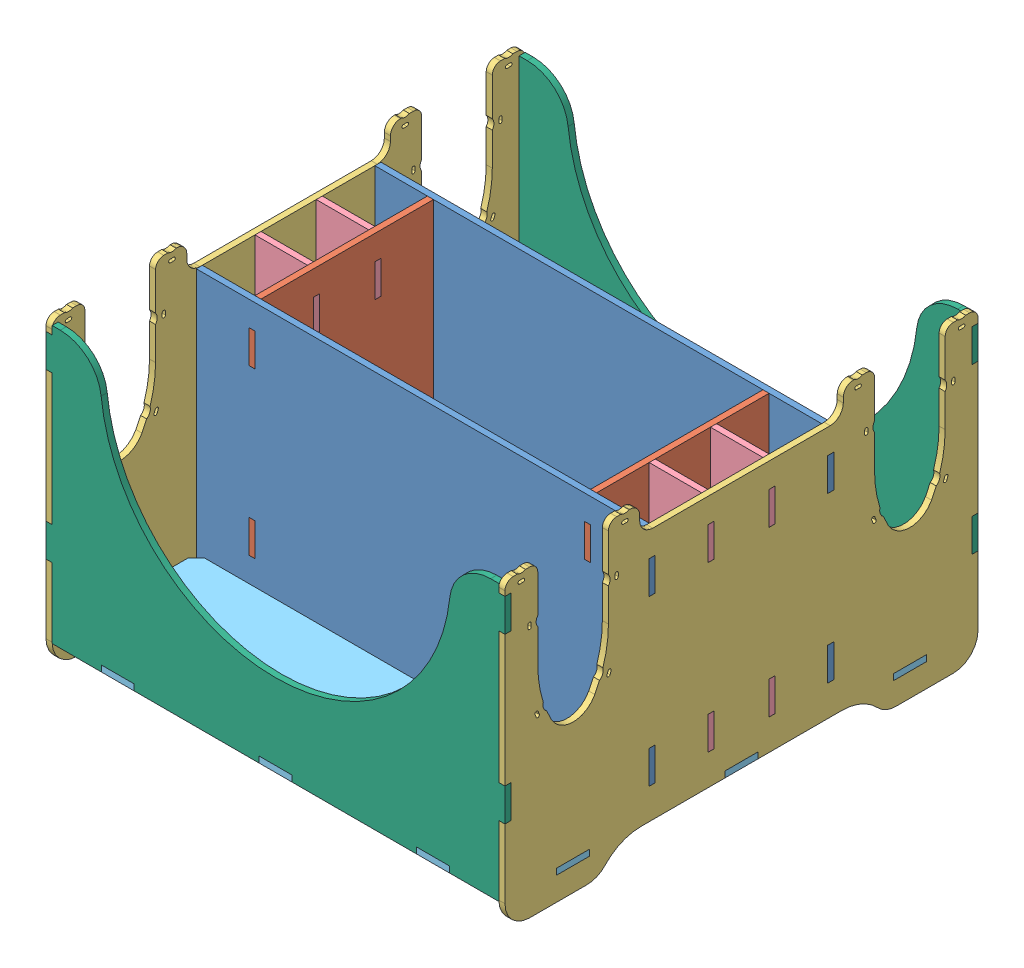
SolidWorks assembly FuelCanModelRack20.SLDASM, configuration Default (file format 5000). Lengths in mm.
Overall size (279.4 185 288).
13 component instances, 6 part files, 26 mates.
Components (placement in the parent):
- SideFast-1: SideFast.SLDPRT [Default] at origin size (279.4 153.7 3.7)
- EndeFast-2: EndeFast.SLDPRT [Default] at (-104 3.7 -52.5) size (3.7 153.7 112.4)
- EndeFast-3: EndeFast.SLDPRT [Default] at (100.3 3.7 -52.5) size (3.7 153.7 112.4)
- SideFast-2: SideFast.SLDPRT [Default] at (0 0 -108.7) size (279.4 153.7 3.7)
- HolderFast-1: HolderFast.SLDPRT [Default] at (-136 3.7 -52.5) x (0 0 1) z (-1 0 0) size (288 185 3.7)
- HolderFast-2: HolderFast.SLDPRT [Default] at (139.7 3.7 -52.5) x (0 0 1) z (-1 0 0) size (288 185 3.7)
- MellemFast-1: MellemFast.SLDPRT [Default] at (120 3.7 -35.7) size (39.4 150 3.7)
- MotorStyrFast-1: MotorStyrFast.SLDPRT [Default] at (0 0 50) x (1 0 0) z (0 1 0) size (279.4 288 3.7)
- MellemFast-2: MellemFast.SLDPRT [Default] at (120 3.7 -73) size (39.4 150 3.7)
- MellemFast-3: MellemFast.SLDPRT [Default] at (-120 3.7 -35.7) size (39.4 150 3.7)
- MellemFast-4: MellemFast.SLDPRT [Default] at (-120 3.7 -73) size (39.4 150 3.7)
- YdersideFast-1: YdersideFast.SLDPRT [Default] at (0 0 87.8) size (279.4 167.7 3.7)
- YdersideFast-2: YdersideFast.SLDPRT [Default] at (0 0 -196.5) size (279.4 167.7 3.7)
Mates (geometry in assembly coordinates):
- Coincident4: coincident anti-aligned: plane of SideFast-1 through (-136 138.7 0) normal (0 0 -1); plane of EndeFast-2 through (-100.3 38.7 0) normal (0 0 1)
- Coincident5: coincident anti-aligned: plane of SideFast-1 through (-104 138.7 3.7) normal (0 -1 0); plane of EndeFast-2 through (-100.3 138.7 3.7) normal (0 1 0)
- Coincident6: coincident anti-aligned: plane of SideFast-1 through (-104 138.7 3.7) normal (1 0 0); plane of EndeFast-2 through (-104 3.7 0) normal (-1 0 0)
- Coincident7: coincident anti-aligned: plane of SideFast-1 through (104 138.7 3.7) normal (-1 0 0); plane of EndeFast-3 through (104 3.7 0) normal (1 0 0)
- Coincident8: coincident anti-aligned: plane of SideFast-1 through (100.3 138.7 3.7) normal (0 -1 0); plane of EndeFast-3 through (104 138.7 3.7) normal (0 1 0)
- Coincident9: coincident anti-aligned: plane of SideFast-1 through (-136 138.7 0) normal (0 0 -1); plane of EndeFast-3 through (104 38.7 0) normal (0 0 1)
- Coincident20: coincident aligned: plane of HolderFast-1; plane of HolderFast-2
- Coincident30: coincident anti-aligned: plane of EndeFast-3 through (104 138.7 -35.7) normal (0 0 1); plane of MellemFast-1 through (104 138.7 -35.7) normal (0 0 -1)
- Coincident31: coincident anti-aligned: plane of EndeFast-3 through (104 138.7 -32) normal (0 -1 0); plane of MellemFast-1 through (100.3 138.7 -32) normal (0 1 0)
- Coincident33: coincident anti-aligned: plane of EndeFast-3 through (104 3.7 0) normal (1 0 0); plane of MellemFast-1 through (104 153.7 -32) normal (-1 0 0)
- Coincident35: coincident anti-aligned: plane of HolderFast-1 through (-139.7 3.7 40) normal (0 -1 0); plane of MotorStyrFast-1 through (0 3.7 46) normal (0 1 0)
- Coincident36: coincident anti-aligned: plane of HolderFast-1 through (-136 165.7 76.5) normal (1 0 0); plane of MotorStyrFast-1 through (-136 3.7 60) normal (-1 0 0)
- Coincident37: coincident anti-aligned: plane of HolderFast-1 through (-139.7 3.7 60) normal (0 0 -1); plane of MotorStyrFast-1 through (-136 3.7 60) normal (0 0 1)
- Coincident38: coincident anti-aligned: plane of SideFast-2 through (136 153.7 -105) normal (1 0 0); plane of HolderFast-2 through (136 165.7 76.5) normal (-1 0 0)
- Coincident39: coincident anti-aligned: plane of EndeFast-3 through (104 3.7 0) normal (1 0 0); plane of SideFast-2 through (104 138.7 -105) normal (-1 0 0)
- Coincident40: coincident anti-aligned: plane of SideFast-2 through (-136 153.7 -105) normal (-1 0 0); plane of HolderFast-1 through (-136 165.7 76.5) normal (1 0 0)
- Coincident41: coincident aligned: plane of HolderFast-1 through (-139.7 153.7 -52.5) normal (0 1 0); plane of HolderFast-2 through (136 153.7 -52.5) normal (0 1 0)
- Coincident42: coincident anti-aligned: plane of SideFast-2 through (136 138.7 -105) normal (0 1 0); plane of HolderFast-2 through (136 138.7 -105) normal (0 -1 0)
- Coincident43: coincident anti-aligned: plane of SideFast-2 through (-136 138.7 -108.7) normal (0 0 -1); plane of HolderFast-2 through (136 138.7 -108.7) normal (0 0 1)
- Coincident44: coincident anti-aligned: plane of EndeFast-3 through (104 138.7 -105) normal (0 1 0); plane of SideFast-2 through (100.3 138.7 -105) normal (0 -1 0)
- Coincident46: coincident anti-aligned: plane of HolderFast-2 through (136 162.7 91.5) normal (0 -1 0); plane of YdersideFast-1 through (139.7 162.7 91.5) normal (0 1 0)
- Coincident47: coincident anti-aligned: plane of HolderFast-2 through (136 165.7 76.5) normal (-1 0 0); plane of YdersideFast-1 through (136 0 91.5) normal (1 0 0)
- Coincident48: coincident anti-aligned: plane of HolderFast-2 through (136 162.7 87.8) normal (0 0 1); plane of YdersideFast-1 through (-131 142.7 87.8) normal (0 0 -1)
- Coincident49: coincident anti-aligned: plane of HolderFast-2 through (136 62.7 -196.5) normal (0 -1 0); plane of YdersideFast-2 through (136 62.7 -192.8) normal (0 1 0)
- Coincident50: coincident anti-aligned: plane of HolderFast-2 through (136 62.7 -192.8) normal (0 0 -1); plane of YdersideFast-2 through (-131 142.7 -192.8) normal (0 0 1)
- Coincident51: coincident anti-aligned: plane of HolderFast-2 through (136 165.7 76.5) normal (-1 0 0); plane of YdersideFast-2 through (136 62.7 -192.8) normal (1 0 0)
